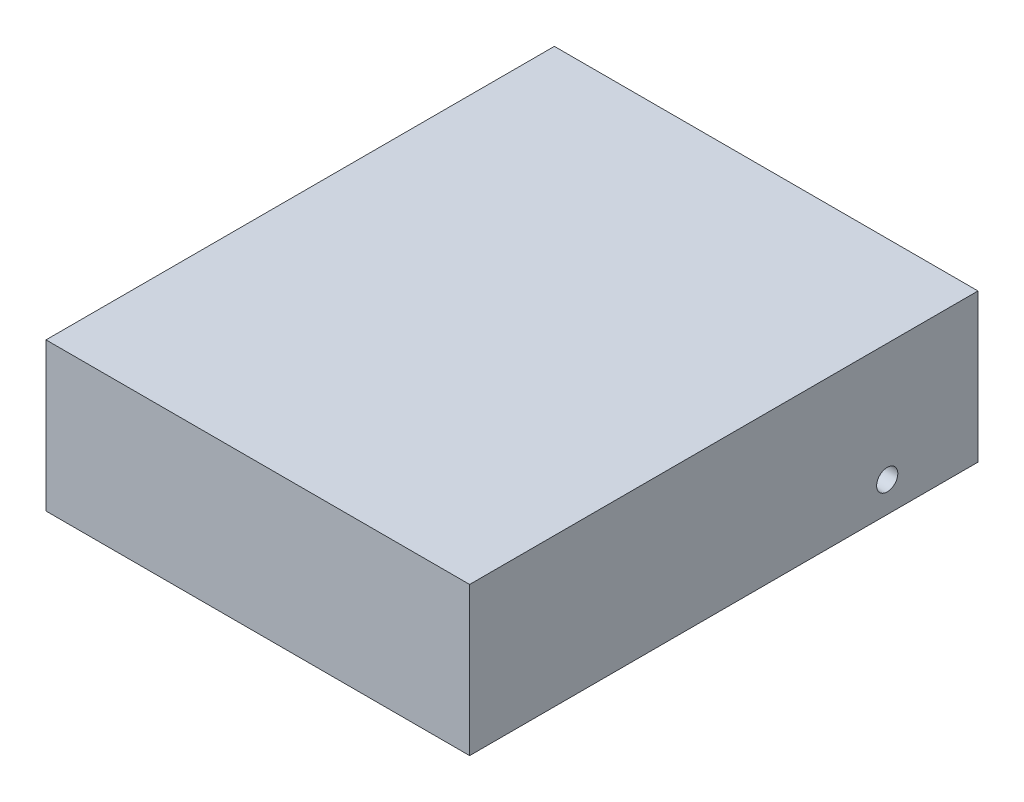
ISO-10303-21;
HEADER;
FILE_DESCRIPTION(('STEP AP214'),'2;1');
FILE_NAME('part.step','',(''),(''),'','','');
FILE_SCHEMA(('AUTOMOTIVE_DESIGN { 1 0 10303 214 1 1 1 1 }'));
ENDSEC;
DATA;
#1=APPLICATION_CONTEXT('core data for automotive mechanical design processes');
#2=APPLICATION_PROTOCOL_DEFINITION('international standard','automotive_design',2000,#1);
#3=PRODUCT_CONTEXT('',#1,'mechanical');
#4=PRODUCT('Part','Part','',(#3));
#5=PRODUCT_RELATED_PRODUCT_CATEGORY('part','',(#4));
#6=PRODUCT_DEFINITION_FORMATION('','',#4);
#7=PRODUCT_DEFINITION_CONTEXT('part definition',#1,'design');
#8=PRODUCT_DEFINITION('design','',#6,#7);
#9=PRODUCT_DEFINITION_SHAPE('','',#8);
#10=(LENGTH_UNIT() NAMED_UNIT(*) SI_UNIT(.MILLI.,.METRE.));
#11=(NAMED_UNIT(*) PLANE_ANGLE_UNIT() SI_UNIT($,.RADIAN.));
#12=(NAMED_UNIT(*) SI_UNIT($,.STERADIAN.) SOLID_ANGLE_UNIT());
#13=UNCERTAINTY_MEASURE_WITH_UNIT(LENGTH_MEASURE(1.E-05),#10,'distance_accuracy_value','');
#14=(GEOMETRIC_REPRESENTATION_CONTEXT(3) GLOBAL_UNCERTAINTY_ASSIGNED_CONTEXT((#13)) GLOBAL_UNIT_ASSIGNED_CONTEXT((#10,
#11,#12)) REPRESENTATION_CONTEXT('',''));
#15=CARTESIAN_POINT('',(0.,0.,0.));
#16=DIRECTION('',(0.,0.,1.));
#17=DIRECTION('',(1.,0.,0.));
#18=AXIS2_PLACEMENT_3D('',#15,#16,#17);
#19=CARTESIAN_POINT('',(-99.6905660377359,29.8622641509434,168.));
#20=DIRECTION('',(1.,0.,0.));
#21=DIRECTION('',(0.,1.,0.));
#22=AXIS2_PLACEMENT_3D('',#19,#20,#21);
#23=PLANE('',#22);
#24=DIRECTION('',(0.,-1.,0.));
#25=VECTOR('',#24,1.);
#26=CARTESIAN_POINT('',(-99.6905660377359,29.8622641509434,0.));
#27=LINE('',#26,#25);
#28=CARTESIAN_POINT('',(-99.6905660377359,29.8622641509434,0.));
#29=VERTEX_POINT('',#28);
#30=CARTESIAN_POINT('',(-99.6905660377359,-19.1377358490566,0.));
#31=VERTEX_POINT('',#30);
#32=EDGE_CURVE('E98',#29,#31,#27,.T.);
#33=ORIENTED_EDGE('',*,*,#32,.T.);
#34=DIRECTION('',(0.,0.,-1.));
#35=VECTOR('',#34,1.);
#36=CARTESIAN_POINT('',(-99.6905660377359,-19.1377358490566,168.));
#37=LINE('',#36,#35);
#38=CARTESIAN_POINT('',(-99.6905660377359,-19.1377358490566,168.));
#39=VERTEX_POINT('',#38);
#40=EDGE_CURVE('E11',#39,#31,#37,.T.);
#41=ORIENTED_EDGE('',*,*,#40,.F.);
#42=DIRECTION('',(0.,-1.,0.));
#43=VECTOR('',#42,1.);
#44=CARTESIAN_POINT('',(-99.6905660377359,29.8622641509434,168.));
#45=LINE('',#44,#43);
#46=CARTESIAN_POINT('',(-99.6905660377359,29.8622641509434,168.));
#47=VERTEX_POINT('',#46);
#48=EDGE_CURVE('E86',#47,#39,#45,.T.);
#49=ORIENTED_EDGE('',*,*,#48,.F.);
#50=DIRECTION('',(0.,0.,-1.));
#51=VECTOR('',#50,1.);
#52=CARTESIAN_POINT('',(-99.6905660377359,29.8622641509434,168.));
#53=LINE('',#52,#51);
#54=EDGE_CURVE('E94',#47,#29,#53,.T.);
#55=ORIENTED_EDGE('',*,*,#54,.T.);
#56=EDGE_LOOP('',(#33,#41,#49,#55));
#57=FACE_BOUND('',#56,.T.);
#58=ADVANCED_FACE('F35',(#57),#23,.F.);
#59=CARTESIAN_POINT('',(-99.6905660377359,-19.1377358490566,168.));
#60=DIRECTION('',(0.,1.,0.));
#61=DIRECTION('',(-1.,0.,0.));
#62=AXIS2_PLACEMENT_3D('',#59,#60,#61);
#63=PLANE('',#62);
#64=DIRECTION('',(1.,0.,0.));
#65=VECTOR('',#64,1.);
#66=CARTESIAN_POINT('',(-99.6905660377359,-19.1377358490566,0.));
#67=LINE('',#66,#65);
#68=CARTESIAN_POINT('',(40.3094339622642,-19.1377358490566,0.));
#69=VERTEX_POINT('',#68);
#70=EDGE_CURVE('E90',#31,#69,#67,.T.);
#71=ORIENTED_EDGE('',*,*,#70,.T.);
#72=DIRECTION('',(0.,0.,-1.));
#73=VECTOR('',#72,1.);
#74=CARTESIAN_POINT('',(40.3094339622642,-19.1377358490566,168.));
#75=LINE('',#74,#73);
#76=CARTESIAN_POINT('',(40.3094339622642,-19.1377358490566,168.));
#77=VERTEX_POINT('',#76);
#78=EDGE_CURVE('E43',#77,#69,#75,.T.);
#79=ORIENTED_EDGE('',*,*,#78,.F.);
#80=DIRECTION('',(1.,0.,0.));
#81=VECTOR('',#80,1.);
#82=CARTESIAN_POINT('',(-99.6905660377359,-19.1377358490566,168.));
#83=LINE('',#82,#81);
#84=EDGE_CURVE('E81',#39,#77,#83,.T.);
#85=ORIENTED_EDGE('',*,*,#84,.F.);
#86=ORIENTED_EDGE('',*,*,#40,.T.);
#87=EDGE_LOOP('',(#71,#79,#85,#86));
#88=FACE_BOUND('',#87,.T.);
#89=ADVANCED_FACE('F89',(#88),#63,.F.);
#90=CARTESIAN_POINT('',(40.3094339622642,29.8622641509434,168.));
#91=DIRECTION('',(-1.,0.,0.));
#92=DIRECTION('',(0.,0.,1.));
#93=AXIS2_PLACEMENT_3D('',#90,#91,#92);
#94=PLANE('',#93);
#95=CARTESIAN_POINT('',(40.3094339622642,-9.1377358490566,30.));
#96=DIRECTION('',(1.,0.,0.));
#97=DIRECTION('',(0.,0.,-1.));
#98=AXIS2_PLACEMENT_3D('',#95,#96,#97);
#99=CIRCLE('',#98,3.5);
#100=CARTESIAN_POINT('',(40.3094339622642,-9.1377358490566,26.5));
#101=VERTEX_POINT('',#100);
#102=EDGE_CURVE('E112',#101,#101,#99,.T.);
#103=ORIENTED_EDGE('',*,*,#102,.F.);
#104=EDGE_LOOP('',(#103));
#105=FACE_BOUND('',#104,.T.);
#106=DIRECTION('',(0.,1.,0.));
#107=VECTOR('',#106,1.);
#108=CARTESIAN_POINT('',(40.3094339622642,29.8622641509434,0.));
#109=LINE('',#108,#107);
#110=CARTESIAN_POINT('',(40.3094339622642,29.8622641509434,0.));
#111=VERTEX_POINT('',#110);
#112=EDGE_CURVE('E68',#69,#111,#109,.T.);
#113=ORIENTED_EDGE('',*,*,#112,.T.);
#114=DIRECTION('',(0.,0.,-1.));
#115=VECTOR('',#114,1.);
#116=CARTESIAN_POINT('',(40.3094339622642,29.8622641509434,168.));
#117=LINE('',#116,#115);
#118=CARTESIAN_POINT('',(40.3094339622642,29.8622641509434,168.));
#119=VERTEX_POINT('',#118);
#120=EDGE_CURVE('E91',#119,#111,#117,.T.);
#121=ORIENTED_EDGE('',*,*,#120,.F.);
#122=DIRECTION('',(0.,1.,0.));
#123=VECTOR('',#122,1.);
#124=CARTESIAN_POINT('',(40.3094339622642,29.8622641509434,168.));
#125=LINE('',#124,#123);
#126=EDGE_CURVE('E84',#77,#119,#125,.T.);
#127=ORIENTED_EDGE('',*,*,#126,.F.);
#128=ORIENTED_EDGE('',*,*,#78,.T.);
#129=EDGE_LOOP('',(#113,#121,#127,#128));
#130=FACE_BOUND('',#129,.T.);
#131=ADVANCED_FACE('F92',(#105,#130),#94,.F.);
#132=CARTESIAN_POINT('',(-99.6905660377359,29.8622641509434,168.));
#133=DIRECTION('',(0.,-1.,0.));
#134=DIRECTION('',(0.,0.,-1.));
#135=AXIS2_PLACEMENT_3D('',#132,#133,#134);
#136=PLANE('',#135);
#137=DIRECTION('',(-1.,0.,0.));
#138=VECTOR('',#137,1.);
#139=CARTESIAN_POINT('',(-99.6905660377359,29.8622641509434,0.));
#140=LINE('',#139,#138);
#141=EDGE_CURVE('E74',#111,#29,#140,.T.);
#142=ORIENTED_EDGE('',*,*,#141,.T.);
#143=ORIENTED_EDGE('',*,*,#54,.F.);
#144=DIRECTION('',(-1.,0.,0.));
#145=VECTOR('',#144,1.);
#146=CARTESIAN_POINT('',(-99.6905660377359,29.8622641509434,168.));
#147=LINE('',#146,#145);
#148=EDGE_CURVE('E51',#119,#47,#147,.T.);
#149=ORIENTED_EDGE('',*,*,#148,.F.);
#150=ORIENTED_EDGE('',*,*,#120,.T.);
#151=EDGE_LOOP('',(#142,#143,#149,#150));
#152=FACE_BOUND('',#151,.T.);
#153=ADVANCED_FACE('F106',(#152),#136,.F.);
#154=CARTESIAN_POINT('',(0.,0.,168.));
#155=DIRECTION('',(0.,0.,1.));
#156=DIRECTION('',(1.,0.,0.));
#157=AXIS2_PLACEMENT_3D('',#154,#155,#156);
#158=PLANE('',#157);
#159=ORIENTED_EDGE('',*,*,#48,.T.);
#160=ORIENTED_EDGE('',*,*,#84,.T.);
#161=ORIENTED_EDGE('',*,*,#126,.T.);
#162=ORIENTED_EDGE('',*,*,#148,.T.);
#163=EDGE_LOOP('',(#159,#160,#161,#162));
#164=FACE_BOUND('',#163,.T.);
#165=ADVANCED_FACE('F82',(#164),#158,.T.);
#166=CARTESIAN_POINT('',(0.,0.,0.));
#167=DIRECTION('',(0.,0.,1.));
#168=DIRECTION('',(1.,0.,0.));
#169=AXIS2_PLACEMENT_3D('',#166,#167,#168);
#170=PLANE('',#169);
#171=ORIENTED_EDGE('',*,*,#32,.F.);
#172=ORIENTED_EDGE('',*,*,#141,.F.);
#173=ORIENTED_EDGE('',*,*,#112,.F.);
#174=ORIENTED_EDGE('',*,*,#70,.F.);
#175=EDGE_LOOP('',(#171,#172,#173,#174));
#176=FACE_BOUND('',#175,.T.);
#177=ADVANCED_FACE('F109',(#176),#170,.F.);
#178=CARTESIAN_POINT('',(35.3094339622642,-9.1377358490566,30.));
#179=DIRECTION('',(1.,0.,0.));
#180=DIRECTION('',(0.,0.,-1.));
#181=AXIS2_PLACEMENT_3D('',#178,#179,#180);
#182=CYLINDRICAL_SURFACE('',#181,3.5);
#183=CARTESIAN_POINT('',(35.3094339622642,-9.1377358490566,30.));
#184=DIRECTION('',(1.,0.,0.));
#185=DIRECTION('',(0.,0.,-1.));
#186=AXIS2_PLACEMENT_3D('',#183,#184,#185);
#187=CIRCLE('',#186,3.5);
#188=CARTESIAN_POINT('',(35.3094339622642,-9.1377358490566,26.5));
#189=VERTEX_POINT('',#188);
#190=EDGE_CURVE('E101',#189,#189,#187,.T.);
#191=ORIENTED_EDGE('',*,*,#190,.F.);
#192=EDGE_LOOP('',(#191));
#193=FACE_BOUND('',#192,.T.);
#194=ORIENTED_EDGE('',*,*,#102,.T.);
#195=EDGE_LOOP('',(#194));
#196=FACE_BOUND('',#195,.T.);
#197=ADVANCED_FACE('F120',(#193,#196),#182,.F.);
#198=CARTESIAN_POINT('',(35.3094339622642,-9.1377358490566,30.));
#199=DIRECTION('',(1.,0.,0.));
#200=DIRECTION('',(0.,0.,-1.));
#201=AXIS2_PLACEMENT_3D('',#198,#199,#200);
#202=PLANE('',#201);
#203=ORIENTED_EDGE('',*,*,#190,.T.);
#204=EDGE_LOOP('',(#203));
#205=FACE_BOUND('',#204,.T.);
#206=ADVANCED_FACE('F118',(#205),#202,.T.);
#207=CLOSED_SHELL('',(#58,#89,#131,#153,#165,#177,#197,#206));
#208=MANIFOLD_SOLID_BREP('B2',#207);
#209=ADVANCED_BREP_SHAPE_REPRESENTATION('',(#18,#208),#14);
#210=SHAPE_DEFINITION_REPRESENTATION(#9,#209);
ENDSEC;
END-ISO-10303-21;
